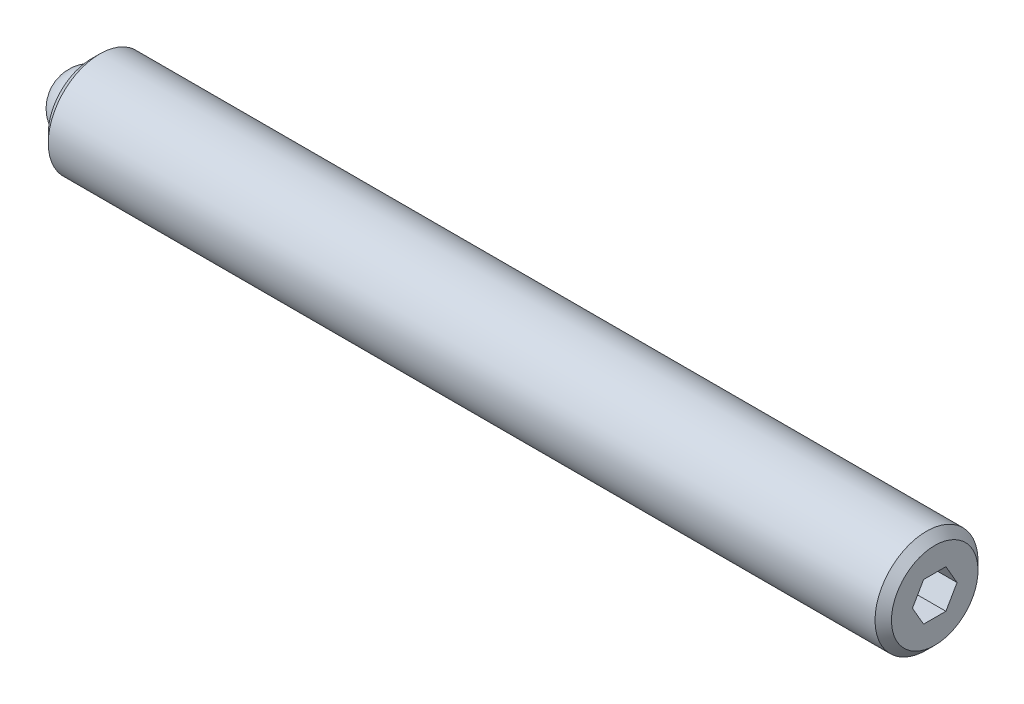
ISO-10303-21;
HEADER;
FILE_DESCRIPTION(('STEP AP214'),'2;1');
FILE_NAME('part.step','',(''),(''),'','','');
FILE_SCHEMA(('AUTOMOTIVE_DESIGN { 1 0 10303 214 1 1 1 1 }'));
ENDSEC;
DATA;
#1=APPLICATION_CONTEXT('core data for automotive mechanical design processes');
#2=APPLICATION_PROTOCOL_DEFINITION('international standard','automotive_design',2000,#1);
#3=PRODUCT_CONTEXT('',#1,'mechanical');
#4=PRODUCT('Part','Part','',(#3));
#5=PRODUCT_RELATED_PRODUCT_CATEGORY('part','',(#4));
#6=PRODUCT_DEFINITION_FORMATION('','',#4);
#7=PRODUCT_DEFINITION_CONTEXT('part definition',#1,'design');
#8=PRODUCT_DEFINITION('design','',#6,#7);
#9=PRODUCT_DEFINITION_SHAPE('','',#8);
#10=(LENGTH_UNIT() NAMED_UNIT(*) SI_UNIT(.MILLI.,.METRE.));
#11=(NAMED_UNIT(*) PLANE_ANGLE_UNIT() SI_UNIT($,.RADIAN.));
#12=(NAMED_UNIT(*) SI_UNIT($,.STERADIAN.) SOLID_ANGLE_UNIT());
#13=UNCERTAINTY_MEASURE_WITH_UNIT(LENGTH_MEASURE(1.E-05),#10,'distance_accuracy_value','');
#14=(GEOMETRIC_REPRESENTATION_CONTEXT(3) GLOBAL_UNCERTAINTY_ASSIGNED_CONTEXT((#13)) GLOBAL_UNIT_ASSIGNED_CONTEXT((#10,
#11,#12)) REPRESENTATION_CONTEXT('',''));
#15=CARTESIAN_POINT('',(0.,0.,0.));
#16=DIRECTION('',(0.,0.,1.));
#17=DIRECTION('',(1.,0.,0.));
#18=AXIS2_PLACEMENT_3D('',#15,#16,#17);
#19=CARTESIAN_POINT('',(0.,0.,0.));
#20=DIRECTION('',(0.,-1.,0.));
#21=DIRECTION('',(0.,0.,1.));
#22=AXIS2_PLACEMENT_3D('',#19,#20,#21);
#23=SPHERICAL_SURFACE('',#22,1.984375);
#24=CARTESIAN_POINT('',(0.,-1.984375,0.));
#25=VERTEX_POINT('',#24);
#26=VERTEX_LOOP('',#25);
#27=FACE_BOUND('',#26,.T.);
#28=ADVANCED_FACE('F43',(#27),#23,.T.);
#29=CLOSED_SHELL('',(#28));
#30=MANIFOLD_SOLID_BREP('B2',#29);
#31=CARTESIAN_POINT('',(51.990625,0.,0.));
#32=DIRECTION('',(-1.,0.,0.));
#33=DIRECTION('',(0.,0.,1.));
#34=AXIS2_PLACEMENT_3D('',#31,#32,#33);
#35=CYLINDRICAL_SURFACE('',#34,3.175);
#36=CARTESIAN_POINT('',(51.482625,0.,0.));
#37=DIRECTION('',(1.,0.,0.));
#38=DIRECTION('',(0.,0.,-1.));
#39=AXIS2_PLACEMENT_3D('',#36,#37,#38);
#40=CIRCLE('',#39,3.175);
#41=CARTESIAN_POINT('',(51.482625,0.,3.175));
#42=VERTEX_POINT('',#41);
#43=EDGE_CURVE('E41',#42,#42,#40,.F.);
#44=CARTESIAN_POINT('',(0.508000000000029,0.,0.));
#45=DIRECTION('',(1.,0.,0.));
#46=DIRECTION('',(0.,0.,-1.));
#47=AXIS2_PLACEMENT_3D('',#44,#45,#46);
#48=CIRCLE('',#47,3.175);
#49=CARTESIAN_POINT('',(0.508000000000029,0.,3.175));
#50=VERTEX_POINT('',#49);
#51=EDGE_CURVE('E159',#50,#50,#48,.T.);
#52=CARTESIAN_POINT('',(51.482625,0.,3.175));
#53=CARTESIAN_POINT('',(50.9516393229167,0.,3.175));
#54=CARTESIAN_POINT('',(50.4206536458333,0.,3.175));
#55=CARTESIAN_POINT('',(49.3586822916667,0.,3.175));
#56=CARTESIAN_POINT('',(48.8276966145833,0.,3.175));
#57=CARTESIAN_POINT('',(47.7657252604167,0.,3.175));
#58=CARTESIAN_POINT('',(47.2347395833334,0.,3.175));
#59=CARTESIAN_POINT('',(46.1727682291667,0.,3.175));
#60=CARTESIAN_POINT('',(45.6417825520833,0.,3.175));
#61=CARTESIAN_POINT('',(44.5798111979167,0.,3.175));
#62=CARTESIAN_POINT('',(44.0488255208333,0.,3.175));
#63=CARTESIAN_POINT('',(42.9868541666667,0.,3.175));
#64=CARTESIAN_POINT('',(42.4558684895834,0.,3.175));
#65=CARTESIAN_POINT('',(41.3938971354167,0.,3.175));
#66=CARTESIAN_POINT('',(40.8629114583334,0.,3.175));
#67=CARTESIAN_POINT('',(39.8009401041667,0.,3.175));
#68=CARTESIAN_POINT('',(39.2699544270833,0.,3.175));
#69=CARTESIAN_POINT('',(38.2079830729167,0.,3.175));
#70=CARTESIAN_POINT('',(37.6769973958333,0.,3.175));
#71=CARTESIAN_POINT('',(36.6150260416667,0.,3.175));
#72=CARTESIAN_POINT('',(36.0840403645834,0.,3.175));
#73=CARTESIAN_POINT('',(35.0220690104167,0.,3.175));
#74=CARTESIAN_POINT('',(34.4910833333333,0.,3.175));
#75=CARTESIAN_POINT('',(33.4291119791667,0.,3.175));
#76=CARTESIAN_POINT('',(32.8981263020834,0.,3.175));
#77=CARTESIAN_POINT('',(31.8361549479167,0.,3.175));
#78=CARTESIAN_POINT('',(31.3051692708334,0.,3.175));
#79=CARTESIAN_POINT('',(30.2431979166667,0.,3.175));
#80=CARTESIAN_POINT('',(29.7122122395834,0.,3.175));
#81=CARTESIAN_POINT('',(28.6502408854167,0.,3.175));
#82=CARTESIAN_POINT('',(28.1192552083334,0.,3.175));
#83=CARTESIAN_POINT('',(27.0572838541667,0.,3.175));
#84=CARTESIAN_POINT('',(26.5262981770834,0.,3.175));
#85=CARTESIAN_POINT('',(25.4643268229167,0.,3.175));
#86=CARTESIAN_POINT('',(24.9333411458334,0.,3.175));
#87=CARTESIAN_POINT('',(23.8713697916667,0.,3.175));
#88=CARTESIAN_POINT('',(23.3403841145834,0.,3.175));
#89=CARTESIAN_POINT('',(22.2784127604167,0.,3.175));
#90=CARTESIAN_POINT('',(21.7474270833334,0.,3.175));
#91=CARTESIAN_POINT('',(20.6854557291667,0.,3.175));
#92=CARTESIAN_POINT('',(20.1544700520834,0.,3.175));
#93=CARTESIAN_POINT('',(19.0924986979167,0.,3.175));
#94=CARTESIAN_POINT('',(18.5615130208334,0.,3.175));
#95=CARTESIAN_POINT('',(17.4995416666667,0.,3.175));
#96=CARTESIAN_POINT('',(16.9685559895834,0.,3.175));
#97=CARTESIAN_POINT('',(15.9065846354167,0.,3.175));
#98=CARTESIAN_POINT('',(15.3755989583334,0.,3.175));
#99=CARTESIAN_POINT('',(14.3136276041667,0.,3.175));
#100=CARTESIAN_POINT('',(13.7826419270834,0.,3.175));
#101=CARTESIAN_POINT('',(12.7206705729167,0.,3.175));
#102=CARTESIAN_POINT('',(12.1896848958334,0.,3.175));
#103=CARTESIAN_POINT('',(11.1277135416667,0.,3.175));
#104=CARTESIAN_POINT('',(10.5967278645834,0.,3.175));
#105=CARTESIAN_POINT('',(9.53475651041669,0.,3.175));
#106=CARTESIAN_POINT('',(9.00377083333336,0.,3.175));
#107=CARTESIAN_POINT('',(7.9417994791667,0.,3.175));
#108=CARTESIAN_POINT('',(7.41081380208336,0.,3.175));
#109=CARTESIAN_POINT('',(6.34884244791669,0.,3.175));
#110=CARTESIAN_POINT('',(5.81785677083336,0.,3.175));
#111=CARTESIAN_POINT('',(4.75588541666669,0.,3.175));
#112=CARTESIAN_POINT('',(4.22489973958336,0.,3.175));
#113=CARTESIAN_POINT('',(3.16292838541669,0.,3.175));
#114=CARTESIAN_POINT('',(2.63194270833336,0.,3.175));
#115=CARTESIAN_POINT('',(1.5699713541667,0.,3.175));
#116=CARTESIAN_POINT('',(1.03898567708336,0.,3.175));
#117=CARTESIAN_POINT('',(0.508000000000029,0.,3.175));
#118=B_SPLINE_CURVE_WITH_KNOTS('',3,(#52,#53,#54,#55,#56,#57,#58,#59,#60,#61,#62,#63,#64,#65,
#66,#67,#68,#69,#70,#71,#72,#73,#74,#75,#76,#77,#78,#79,#80,#81,#82,#83,#84,#85,#86,#87,#88,#89,
#90,#91,#92,#93,#94,#95,#96,#97,#98,#99,#100,#101,#102,#103,#104,#105,#106,#107,#108,#109,#110,
#111,#112,#113,#114,#115,#116,#117),.UNSPECIFIED.,.F.,.F.,(4,2,2,2,2,2,2,2,2,2,2,2,2,2,2,2,2,2,
2,2,2,2,2,2,2,2,2,2,2,2,2,2,4),(0.,1.59295703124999,3.1859140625,4.77887109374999,
6.37182812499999,7.96478515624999,9.55774218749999,11.15069921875,12.74365625,14.33661328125,
15.9295703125,17.52252734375,19.115484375,20.70844140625,22.3013984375,23.89435546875,
25.4873125,27.08026953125,28.6732265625,30.26618359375,31.859140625,33.45209765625,
35.0450546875,36.63801171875,38.23096875,39.82392578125,41.4168828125,43.00983984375,
44.602796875,46.19575390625,47.7887109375,49.38166796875,50.974625),.UNSPECIFIED.);
#119=EDGE_CURVE('BSEAM56',#42,#50,#118,.T.);
#120=ORIENTED_EDGE('',*,*,#43,.T.);
#121=ORIENTED_EDGE('',*,*,#51,.T.);
#122=ORIENTED_EDGE('',*,*,#119,.T.);
#123=ORIENTED_EDGE('',*,*,#119,.F.);
#124=EDGE_LOOP('',(#120,#122,#121,#123));
#125=FACE_BOUND('',#124,.T.);
#126=ADVANCED_FACE('F56',(#125),#35,.T.);
#127=CARTESIAN_POINT('',(51.990625,0.,0.));
#128=DIRECTION('',(1.,0.,0.));
#129=DIRECTION('',(0.,0.,-1.));
#130=AXIS2_PLACEMENT_3D('',#127,#128,#129);
#131=PLANE('',#130);
#132=DIRECTION('',(0.,0.866025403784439,-0.5));
#133=VECTOR('',#132,1.);
#134=CARTESIAN_POINT('',(51.990625,-1.190625,-0.687407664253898));
#135=LINE('',#134,#133);
#136=CARTESIAN_POINT('',(51.990625,-1.190625,-0.687407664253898));
#137=VERTEX_POINT('',#136);
#138=CARTESIAN_POINT('',(51.990625,0.,-1.3748153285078));
#139=VERTEX_POINT('',#138);
#140=EDGE_CURVE('E71',#137,#139,#135,.T.);
#141=ORIENTED_EDGE('',*,*,#140,.F.);
#142=DIRECTION('',(0.,0.,-1.));
#143=VECTOR('',#142,1.);
#144=CARTESIAN_POINT('',(51.990625,-1.190625,0.687407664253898));
#145=LINE('',#144,#143);
#146=CARTESIAN_POINT('',(51.990625,-1.190625,0.687407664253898));
#147=VERTEX_POINT('',#146);
#148=EDGE_CURVE('E155',#147,#137,#145,.T.);
#149=ORIENTED_EDGE('',*,*,#148,.F.);
#150=DIRECTION('',(0.,-0.866025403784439,-0.5));
#151=VECTOR('',#150,1.);
#152=CARTESIAN_POINT('',(51.990625,0.,1.3748153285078));
#153=LINE('',#152,#151);
#154=CARTESIAN_POINT('',(51.990625,0.,1.3748153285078));
#155=VERTEX_POINT('',#154);
#156=EDGE_CURVE('E153',#155,#147,#153,.T.);
#157=ORIENTED_EDGE('',*,*,#156,.F.);
#158=DIRECTION('',(0.,-0.866025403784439,0.5));
#159=VECTOR('',#158,1.);
#160=CARTESIAN_POINT('',(51.990625,1.190625,0.687407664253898));
#161=LINE('',#160,#159);
#162=CARTESIAN_POINT('',(51.990625,1.190625,0.687407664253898));
#163=VERTEX_POINT('',#162);
#164=EDGE_CURVE('E119',#163,#155,#161,.T.);
#165=ORIENTED_EDGE('',*,*,#164,.F.);
#166=DIRECTION('',(0.,0.,1.));
#167=VECTOR('',#166,1.);
#168=CARTESIAN_POINT('',(51.990625,1.190625,-0.687407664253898));
#169=LINE('',#168,#167);
#170=CARTESIAN_POINT('',(51.990625,1.190625,-0.687407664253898));
#171=VERTEX_POINT('',#170);
#172=EDGE_CURVE('E149',#171,#163,#169,.T.);
#173=ORIENTED_EDGE('',*,*,#172,.F.);
#174=DIRECTION('',(0.,0.866025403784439,0.5));
#175=VECTOR('',#174,1.);
#176=CARTESIAN_POINT('',(51.990625,0.,-1.3748153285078));
#177=LINE('',#176,#175);
#178=EDGE_CURVE('E145',#139,#171,#177,.T.);
#179=ORIENTED_EDGE('',*,*,#178,.F.);
#180=EDGE_LOOP('',(#141,#149,#157,#165,#173,#179));
#181=FACE_BOUND('',#180,.T.);
#182=CARTESIAN_POINT('',(51.990625,0.,0.));
#183=DIRECTION('',(1.,0.,0.));
#184=DIRECTION('',(0.,0.,-1.));
#185=AXIS2_PLACEMENT_3D('',#182,#183,#184);
#186=CIRCLE('',#185,2.66700000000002);
#187=CARTESIAN_POINT('',(51.990625,0.,-2.66700000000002));
#188=VERTEX_POINT('',#187);
#189=EDGE_CURVE('E64',#188,#188,#186,.T.);
#190=ORIENTED_EDGE('',*,*,#189,.T.);
#191=EDGE_LOOP('',(#190));
#192=FACE_BOUND('',#191,.T.);
#193=ADVANCED_FACE('F172',(#181,#192),#131,.T.);
#194=CARTESIAN_POINT('',(0.,0.,0.));
#195=DIRECTION('',(1.,0.,0.));
#196=DIRECTION('',(0.,0.,-1.));
#197=AXIS2_PLACEMENT_3D('',#194,#195,#196);
#198=PLANE('',#197);
#199=CARTESIAN_POINT('',(0.,0.,0.));
#200=DIRECTION('',(-1.,0.,0.));
#201=DIRECTION('',(0.,0.,1.));
#202=AXIS2_PLACEMENT_3D('',#199,#200,#201);
#203=CIRCLE('',#202,1.9812);
#204=CARTESIAN_POINT('',(0.,0.,1.9812));
#205=VERTEX_POINT('',#204);
#206=EDGE_CURVE('E227',#205,#205,#203,.T.);
#207=ORIENTED_EDGE('',*,*,#206,.F.);
#208=EDGE_LOOP('',(#207));
#209=FACE_BOUND('',#208,.T.);
#210=CARTESIAN_POINT('',(0.,0.,0.));
#211=DIRECTION('',(1.,0.,0.));
#212=DIRECTION('',(0.,0.,-1.));
#213=AXIS2_PLACEMENT_3D('',#210,#211,#212);
#214=CIRCLE('',#213,2.66699999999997);
#215=CARTESIAN_POINT('',(0.,0.,-2.66699999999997));
#216=VERTEX_POINT('',#215);
#217=EDGE_CURVE('E167',#216,#216,#214,.F.);
#218=ORIENTED_EDGE('',*,*,#217,.T.);
#219=EDGE_LOOP('',(#218));
#220=FACE_BOUND('',#219,.T.);
#221=ADVANCED_FACE('F184',(#209,#220),#198,.F.);
#222=CARTESIAN_POINT('',(0.508000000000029,0.,0.));
#223=DIRECTION('',(1.,0.,0.));
#224=DIRECTION('',(0.,0.,-1.));
#225=AXIS2_PLACEMENT_3D('',#222,#223,#224);
#226=CONICAL_SURFACE('',#225,3.175,0.785398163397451);
#227=ORIENTED_EDGE('',*,*,#217,.F.);
#228=EDGE_LOOP('',(#227));
#229=FACE_BOUND('',#228,.T.);
#230=ORIENTED_EDGE('',*,*,#51,.F.);
#231=EDGE_LOOP('',(#230));
#232=FACE_BOUND('',#231,.T.);
#233=ADVANCED_FACE('F176',(#229,#232),#226,.T.);
#234=CARTESIAN_POINT('',(51.990625,0.,0.));
#235=DIRECTION('',(-1.,0.,0.));
#236=DIRECTION('',(0.,0.,1.));
#237=AXIS2_PLACEMENT_3D('',#234,#235,#236);
#238=CONICAL_SURFACE('',#237,2.66700000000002,0.785398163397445);
#239=ORIENTED_EDGE('',*,*,#43,.F.);
#240=EDGE_LOOP('',(#239));
#241=FACE_BOUND('',#240,.T.);
#242=ORIENTED_EDGE('',*,*,#189,.F.);
#243=EDGE_LOOP('',(#242));
#244=FACE_BOUND('',#243,.T.);
#245=ADVANCED_FACE('F58',(#241,#244),#238,.T.);
#246=CARTESIAN_POINT('',(49.704625,-1.190625,-0.687407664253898));
#247=DIRECTION('',(0.,-0.5,-0.866025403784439));
#248=DIRECTION('',(0.,0.866025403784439,-0.5));
#249=AXIS2_PLACEMENT_3D('',#246,#247,#248);
#250=PLANE('',#249);
#251=ORIENTED_EDGE('',*,*,#140,.T.);
#252=DIRECTION('',(1.,0.,0.));
#253=VECTOR('',#252,1.);
#254=CARTESIAN_POINT('',(49.704625,0.,-1.3748153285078));
#255=LINE('',#254,#253);
#256=CARTESIAN_POINT('',(49.704625,0.,-1.3748153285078));
#257=VERTEX_POINT('',#256);
#258=EDGE_CURVE('E101',#257,#139,#255,.T.);
#259=ORIENTED_EDGE('',*,*,#258,.F.);
#260=DIRECTION('',(0.,0.866025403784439,-0.5));
#261=VECTOR('',#260,1.);
#262=CARTESIAN_POINT('',(49.704625,-1.190625,-0.687407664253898));
#263=LINE('',#262,#261);
#264=CARTESIAN_POINT('',(49.704625,-1.190625,-0.687407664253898));
#265=VERTEX_POINT('',#264);
#266=EDGE_CURVE('E157',#265,#257,#263,.T.);
#267=ORIENTED_EDGE('',*,*,#266,.F.);
#268=DIRECTION('',(1.,0.,0.));
#269=VECTOR('',#268,1.);
#270=CARTESIAN_POINT('',(49.704625,-1.190625,-0.687407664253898));
#271=LINE('',#270,#269);
#272=EDGE_CURVE('E79',#265,#137,#271,.T.);
#273=ORIENTED_EDGE('',*,*,#272,.T.);
#274=EDGE_LOOP('',(#251,#259,#267,#273));
#275=FACE_BOUND('',#274,.T.);
#276=ADVANCED_FACE('F175',(#275),#250,.F.);
#277=CARTESIAN_POINT('',(49.704625,-1.190625,0.687407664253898));
#278=DIRECTION('',(0.,-1.,0.));
#279=DIRECTION('',(0.,0.,-1.));
#280=AXIS2_PLACEMENT_3D('',#277,#278,#279);
#281=PLANE('',#280);
#282=ORIENTED_EDGE('',*,*,#148,.T.);
#283=ORIENTED_EDGE('',*,*,#272,.F.);
#284=DIRECTION('',(0.,0.,-1.));
#285=VECTOR('',#284,1.);
#286=CARTESIAN_POINT('',(49.704625,-1.190625,0.687407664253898));
#287=LINE('',#286,#285);
#288=CARTESIAN_POINT('',(49.704625,-1.190625,0.687407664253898));
#289=VERTEX_POINT('',#288);
#290=EDGE_CURVE('E131',#289,#265,#287,.T.);
#291=ORIENTED_EDGE('',*,*,#290,.F.);
#292=DIRECTION('',(1.,0.,0.));
#293=VECTOR('',#292,1.);
#294=CARTESIAN_POINT('',(49.704625,-1.190625,0.687407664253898));
#295=LINE('',#294,#293);
#296=EDGE_CURVE('E123',#289,#147,#295,.T.);
#297=ORIENTED_EDGE('',*,*,#296,.T.);
#298=EDGE_LOOP('',(#282,#283,#291,#297));
#299=FACE_BOUND('',#298,.T.);
#300=ADVANCED_FACE('F182',(#299),#281,.F.);
#301=CARTESIAN_POINT('',(49.704625,0.,1.3748153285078));
#302=DIRECTION('',(0.,-0.5,0.866025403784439));
#303=DIRECTION('',(0.,-0.866025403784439,-0.5));
#304=AXIS2_PLACEMENT_3D('',#301,#302,#303);
#305=PLANE('',#304);
#306=ORIENTED_EDGE('',*,*,#156,.T.);
#307=ORIENTED_EDGE('',*,*,#296,.F.);
#308=DIRECTION('',(0.,-0.866025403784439,-0.5));
#309=VECTOR('',#308,1.);
#310=CARTESIAN_POINT('',(49.704625,0.,1.3748153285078));
#311=LINE('',#310,#309);
#312=CARTESIAN_POINT('',(49.704625,0.,1.3748153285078));
#313=VERTEX_POINT('',#312);
#314=EDGE_CURVE('E127',#313,#289,#311,.T.);
#315=ORIENTED_EDGE('',*,*,#314,.F.);
#316=DIRECTION('',(1.,0.,0.));
#317=VECTOR('',#316,1.);
#318=CARTESIAN_POINT('',(49.704625,0.,1.3748153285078));
#319=LINE('',#318,#317);
#320=EDGE_CURVE('E112',#313,#155,#319,.T.);
#321=ORIENTED_EDGE('',*,*,#320,.T.);
#322=EDGE_LOOP('',(#306,#307,#315,#321));
#323=FACE_BOUND('',#322,.T.);
#324=ADVANCED_FACE('F128',(#323),#305,.F.);
#325=CARTESIAN_POINT('',(49.704625,1.190625,0.687407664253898));
#326=DIRECTION('',(0.,0.5,0.866025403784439));
#327=DIRECTION('',(0.,-0.866025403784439,0.5));
#328=AXIS2_PLACEMENT_3D('',#325,#326,#327);
#329=PLANE('',#328);
#330=ORIENTED_EDGE('',*,*,#164,.T.);
#331=ORIENTED_EDGE('',*,*,#320,.F.);
#332=DIRECTION('',(0.,-0.866025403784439,0.5));
#333=VECTOR('',#332,1.);
#334=CARTESIAN_POINT('',(49.704625,1.190625,0.687407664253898));
#335=LINE('',#334,#333);
#336=CARTESIAN_POINT('',(49.704625,1.190625,0.687407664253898));
#337=VERTEX_POINT('',#336);
#338=EDGE_CURVE('E116',#337,#313,#335,.T.);
#339=ORIENTED_EDGE('',*,*,#338,.F.);
#340=DIRECTION('',(1.,0.,0.));
#341=VECTOR('',#340,1.);
#342=CARTESIAN_POINT('',(49.704625,1.190625,0.687407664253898));
#343=LINE('',#342,#341);
#344=EDGE_CURVE('E124',#337,#163,#343,.T.);
#345=ORIENTED_EDGE('',*,*,#344,.T.);
#346=EDGE_LOOP('',(#330,#331,#339,#345));
#347=FACE_BOUND('',#346,.T.);
#348=ADVANCED_FACE('F114',(#347),#329,.F.);
#349=CARTESIAN_POINT('',(49.704625,1.190625,-0.687407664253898));
#350=DIRECTION('',(0.,1.,0.));
#351=DIRECTION('',(0.,0.,1.));
#352=AXIS2_PLACEMENT_3D('',#349,#350,#351);
#353=PLANE('',#352);
#354=ORIENTED_EDGE('',*,*,#172,.T.);
#355=ORIENTED_EDGE('',*,*,#344,.F.);
#356=DIRECTION('',(0.,0.,1.));
#357=VECTOR('',#356,1.);
#358=CARTESIAN_POINT('',(49.704625,1.190625,-0.687407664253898));
#359=LINE('',#358,#357);
#360=CARTESIAN_POINT('',(49.704625,1.190625,-0.687407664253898));
#361=VERTEX_POINT('',#360);
#362=EDGE_CURVE('E137',#361,#337,#359,.T.);
#363=ORIENTED_EDGE('',*,*,#362,.F.);
#364=DIRECTION('',(1.,0.,0.));
#365=VECTOR('',#364,1.);
#366=CARTESIAN_POINT('',(49.704625,1.190625,-0.687407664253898));
#367=LINE('',#366,#365);
#368=EDGE_CURVE('E162',#361,#171,#367,.T.);
#369=ORIENTED_EDGE('',*,*,#368,.T.);
#370=EDGE_LOOP('',(#354,#355,#363,#369));
#371=FACE_BOUND('',#370,.T.);
#372=ADVANCED_FACE('F203',(#371),#353,.F.);
#373=CARTESIAN_POINT('',(49.704625,0.,-1.3748153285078));
#374=DIRECTION('',(0.,0.5,-0.866025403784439));
#375=DIRECTION('',(0.,0.866025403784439,0.5));
#376=AXIS2_PLACEMENT_3D('',#373,#374,#375);
#377=PLANE('',#376);
#378=ORIENTED_EDGE('',*,*,#178,.T.);
#379=ORIENTED_EDGE('',*,*,#368,.F.);
#380=DIRECTION('',(0.,0.866025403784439,0.5));
#381=VECTOR('',#380,1.);
#382=CARTESIAN_POINT('',(49.704625,0.,-1.3748153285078));
#383=LINE('',#382,#381);
#384=EDGE_CURVE('E139',#257,#361,#383,.T.);
#385=ORIENTED_EDGE('',*,*,#384,.F.);
#386=ORIENTED_EDGE('',*,*,#258,.T.);
#387=EDGE_LOOP('',(#378,#379,#385,#386));
#388=FACE_BOUND('',#387,.T.);
#389=ADVANCED_FACE('F200',(#388),#377,.F.);
#390=CARTESIAN_POINT('',(49.704625,0.,0.));
#391=DIRECTION('',(1.,0.,0.));
#392=DIRECTION('',(0.,0.,-1.));
#393=AXIS2_PLACEMENT_3D('',#390,#391,#392);
#394=PLANE('',#393);
#395=ORIENTED_EDGE('',*,*,#266,.T.);
#396=ORIENTED_EDGE('',*,*,#384,.T.);
#397=ORIENTED_EDGE('',*,*,#362,.T.);
#398=ORIENTED_EDGE('',*,*,#338,.T.);
#399=ORIENTED_EDGE('',*,*,#314,.T.);
#400=ORIENTED_EDGE('',*,*,#290,.T.);
#401=EDGE_LOOP('',(#395,#396,#397,#398,#399,#400));
#402=FACE_BOUND('',#401,.T.);
#403=ADVANCED_FACE('F134',(#402),#394,.T.);
#404=CARTESIAN_POINT('',(1.984375,0.,0.));
#405=DIRECTION('',(-1.,0.,0.));
#406=DIRECTION('',(0.,0.,1.));
#407=AXIS2_PLACEMENT_3D('',#404,#405,#406);
#408=CYLINDRICAL_SURFACE('',#407,1.9812);
#409=CARTESIAN_POINT('',(1.984375,0.,0.));
#410=DIRECTION('',(-1.,0.,0.));
#411=DIRECTION('',(0.,0.,1.));
#412=AXIS2_PLACEMENT_3D('',#409,#410,#411);
#413=CIRCLE('',#412,1.9812);
#414=CARTESIAN_POINT('',(1.984375,0.,1.9812));
#415=VERTEX_POINT('',#414);
#416=EDGE_CURVE('E146',#415,#415,#413,.T.);
#417=ORIENTED_EDGE('',*,*,#416,.F.);
#418=EDGE_LOOP('',(#417));
#419=FACE_BOUND('',#418,.T.);
#420=ORIENTED_EDGE('',*,*,#206,.T.);
#421=EDGE_LOOP('',(#420));
#422=FACE_BOUND('',#421,.T.);
#423=ADVANCED_FACE('F216',(#419,#422),#408,.F.);
#424=CARTESIAN_POINT('',(1.984375,0.,0.));
#425=DIRECTION('',(-1.,0.,0.));
#426=DIRECTION('',(0.,0.,1.));
#427=AXIS2_PLACEMENT_3D('',#424,#425,#426);
#428=PLANE('',#427);
#429=ORIENTED_EDGE('',*,*,#416,.T.);
#430=EDGE_LOOP('',(#429));
#431=FACE_BOUND('',#430,.T.);
#432=ADVANCED_FACE('F219',(#431),#428,.T.);
#433=CLOSED_SHELL('',(#126,#193,#221,#233,#245,#276,#300,#324,#348,#372,#389,#403,#423,#432));
#434=MANIFOLD_SOLID_BREP('B6',#433);
#435=ADVANCED_BREP_SHAPE_REPRESENTATION('',(#18,#30,#434),#14);
#436=SHAPE_DEFINITION_REPRESENTATION(#9,#435);
ENDSEC;
END-ISO-10303-21;
